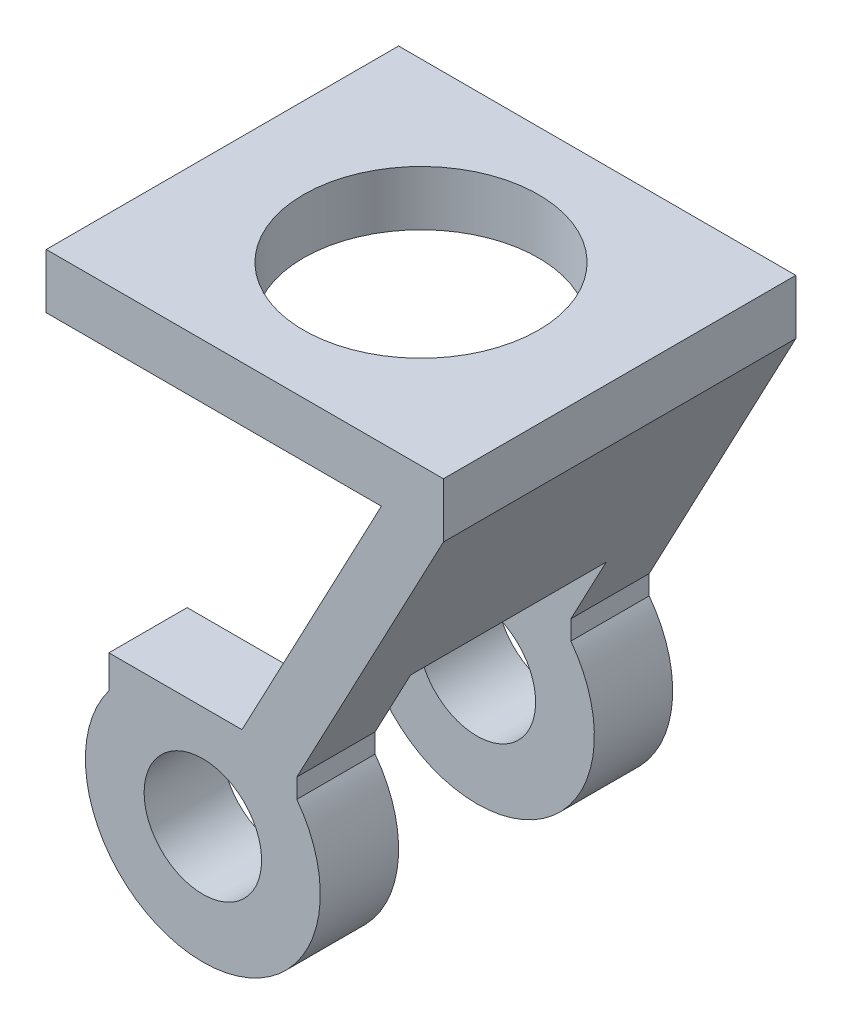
ISO-10303-21;
HEADER;
FILE_DESCRIPTION(('STEP AP214'),'2;1');
FILE_NAME('part.step','',(''),(''),'','','');
FILE_SCHEMA(('AUTOMOTIVE_DESIGN { 1 0 10303 214 1 1 1 1 }'));
ENDSEC;
DATA;
#1=APPLICATION_CONTEXT('core data for automotive mechanical design processes');
#2=APPLICATION_PROTOCOL_DEFINITION('international standard','automotive_design',2000,#1);
#3=PRODUCT_CONTEXT('',#1,'mechanical');
#4=PRODUCT('Part','Part','',(#3));
#5=PRODUCT_RELATED_PRODUCT_CATEGORY('part','',(#4));
#6=PRODUCT_DEFINITION_FORMATION('','',#4);
#7=PRODUCT_DEFINITION_CONTEXT('part definition',#1,'design');
#8=PRODUCT_DEFINITION('design','',#6,#7);
#9=PRODUCT_DEFINITION_SHAPE('','',#8);
#10=(LENGTH_UNIT() NAMED_UNIT(*) SI_UNIT(.MILLI.,.METRE.));
#11=(NAMED_UNIT(*) PLANE_ANGLE_UNIT() SI_UNIT($,.RADIAN.));
#12=(NAMED_UNIT(*) SI_UNIT($,.STERADIAN.) SOLID_ANGLE_UNIT());
#13=UNCERTAINTY_MEASURE_WITH_UNIT(LENGTH_MEASURE(1.E-05),#10,'distance_accuracy_value','');
#14=(GEOMETRIC_REPRESENTATION_CONTEXT(3) GLOBAL_UNCERTAINTY_ASSIGNED_CONTEXT((#13)) GLOBAL_UNIT_ASSIGNED_CONTEXT((#10,
#11,#12)) REPRESENTATION_CONTEXT('',''));
#15=CARTESIAN_POINT('',(0.,0.,0.));
#16=DIRECTION('',(0.,0.,1.));
#17=DIRECTION('',(1.,0.,0.));
#18=AXIS2_PLACEMENT_3D('',#15,#16,#17);
#19=CARTESIAN_POINT('',(5.,13.2086241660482,45.));
#20=DIRECTION('',(0.,-1.,0.));
#21=DIRECTION('',(1.,0.,0.));
#22=AXIS2_PLACEMENT_3D('',#19,#20,#21);
#23=PLANE('',#22);
#24=DIRECTION('',(0.,0.,-1.));
#25=VECTOR('',#24,1.);
#26=CARTESIAN_POINT('',(5.,13.2086241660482,45.));
#27=LINE('',#26,#25);
#28=CARTESIAN_POINT('',(5.,13.2086241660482,45.));
#29=VERTEX_POINT('',#28);
#30=CARTESIAN_POINT('',(5.,13.2086241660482,35.));
#31=VERTEX_POINT('',#30);
#32=EDGE_CURVE('E213',#29,#31,#27,.T.);
#33=ORIENTED_EDGE('',*,*,#32,.T.);
#34=DIRECTION('',(-1.,0.,0.));
#35=VECTOR('',#34,1.);
#36=CARTESIAN_POINT('',(5.,13.2086241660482,35.));
#37=LINE('',#36,#35);
#38=CARTESIAN_POINT('',(-12.,13.2086241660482,35.));
#39=VERTEX_POINT('',#38);
#40=EDGE_CURVE('E250',#31,#39,#37,.T.);
#41=ORIENTED_EDGE('',*,*,#40,.T.);
#42=DIRECTION('',(0.,0.,-1.));
#43=VECTOR('',#42,1.);
#44=CARTESIAN_POINT('',(-12.,13.2086241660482,45.));
#45=LINE('',#44,#43);
#46=CARTESIAN_POINT('',(-12.,13.2086241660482,45.));
#47=VERTEX_POINT('',#46);
#48=EDGE_CURVE('E209',#47,#39,#45,.T.);
#49=ORIENTED_EDGE('',*,*,#48,.F.);
#50=DIRECTION('',(-1.,0.,0.));
#51=VECTOR('',#50,1.);
#52=CARTESIAN_POINT('',(5.,13.2086241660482,45.));
#53=LINE('',#52,#51);
#54=EDGE_CURVE('E265',#29,#47,#53,.T.);
#55=ORIENTED_EDGE('',*,*,#54,.F.);
#56=EDGE_LOOP('',(#33,#41,#49,#55));
#57=FACE_BOUND('',#56,.T.);
#58=ADVANCED_FACE('F45',(#57),#23,.F.);
#59=CARTESIAN_POINT('',(-12.,13.2086241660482,45.));
#60=DIRECTION('',(1.,0.,0.));
#61=DIRECTION('',(0.,0.,-1.));
#62=AXIS2_PLACEMENT_3D('',#59,#60,#61);
#63=PLANE('',#62);
#64=ORIENTED_EDGE('',*,*,#48,.T.);
#65=DIRECTION('',(0.,-1.,0.));
#66=VECTOR('',#65,1.);
#67=CARTESIAN_POINT('',(-12.,13.2086241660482,35.));
#68=LINE('',#67,#66);
#69=CARTESIAN_POINT('',(-12.,9.,35.));
#70=VERTEX_POINT('',#69);
#71=EDGE_CURVE('E247',#39,#70,#68,.T.);
#72=ORIENTED_EDGE('',*,*,#71,.T.);
#73=DIRECTION('',(0.,0.,-1.));
#74=VECTOR('',#73,1.);
#75=CARTESIAN_POINT('',(-12.,9.,45.));
#76=LINE('',#75,#74);
#77=CARTESIAN_POINT('',(-12.,9.,45.));
#78=VERTEX_POINT('',#77);
#79=EDGE_CURVE('E205',#78,#70,#76,.T.);
#80=ORIENTED_EDGE('',*,*,#79,.F.);
#81=DIRECTION('',(0.,-1.,0.));
#82=VECTOR('',#81,1.);
#83=CARTESIAN_POINT('',(-12.,13.2086241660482,45.));
#84=LINE('',#83,#82);
#85=EDGE_CURVE('E267',#47,#78,#84,.T.);
#86=ORIENTED_EDGE('',*,*,#85,.F.);
#87=EDGE_LOOP('',(#64,#72,#80,#86));
#88=FACE_BOUND('',#87,.T.);
#89=ADVANCED_FACE('F302',(#88),#63,.F.);
#90=CARTESIAN_POINT('',(0.,0.,45.));
#91=DIRECTION('',(0.,0.,-1.));
#92=DIRECTION('',(-1.,0.,0.));
#93=AXIS2_PLACEMENT_3D('',#90,#91,#92);
#94=CYLINDRICAL_SURFACE('',#93,15.);
#95=CARTESIAN_POINT('',(0.,0.,35.));
#96=DIRECTION('',(0.,0.,1.));
#97=DIRECTION('',(0.,-1.,0.));
#98=AXIS2_PLACEMENT_3D('',#95,#96,#97);
#99=CIRCLE('',#98,15.);
#100=CARTESIAN_POINT('',(12.,9.,35.));
#101=VERTEX_POINT('',#100);
#102=EDGE_CURVE('E244',#70,#101,#99,.T.);
#103=ORIENTED_EDGE('',*,*,#102,.T.);
#104=DIRECTION('',(0.,0.,-1.));
#105=VECTOR('',#104,1.);
#106=CARTESIAN_POINT('',(12.,9.,45.));
#107=LINE('',#106,#105);
#108=CARTESIAN_POINT('',(12.,9.,45.));
#109=VERTEX_POINT('',#108);
#110=EDGE_CURVE('E201',#109,#101,#107,.T.);
#111=ORIENTED_EDGE('',*,*,#110,.F.);
#112=CARTESIAN_POINT('',(0.,0.,45.));
#113=DIRECTION('',(0.,0.,1.));
#114=DIRECTION('',(1.,0.,0.));
#115=AXIS2_PLACEMENT_3D('',#112,#113,#114);
#116=CIRCLE('',#115,15.);
#117=EDGE_CURVE('E269',#78,#109,#116,.T.);
#118=ORIENTED_EDGE('',*,*,#117,.F.);
#119=ORIENTED_EDGE('',*,*,#79,.T.);
#120=EDGE_LOOP('',(#103,#111,#118,#119));
#121=FACE_BOUND('',#120,.T.);
#122=ADVANCED_FACE('F306',(#121),#94,.T.);
#123=CARTESIAN_POINT('',(12.,9.,45.));
#124=DIRECTION('',(-1.,0.,0.));
#125=DIRECTION('',(0.,0.,1.));
#126=AXIS2_PLACEMENT_3D('',#123,#124,#125);
#127=PLANE('',#126);
#128=ORIENTED_EDGE('',*,*,#110,.T.);
#129=DIRECTION('',(0.,1.,0.));
#130=VECTOR('',#129,1.);
#131=CARTESIAN_POINT('',(12.,9.,35.));
#132=LINE('',#131,#130);
#133=CARTESIAN_POINT('',(12.,11.4693839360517,35.));
#134=VERTEX_POINT('',#133);
#135=EDGE_CURVE('E228',#101,#134,#132,.T.);
#136=ORIENTED_EDGE('',*,*,#135,.T.);
#137=DIRECTION('',(0.,0.,-1.));
#138=VECTOR('',#137,1.);
#139=CARTESIAN_POINT('',(12.,11.4693839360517,45.));
#140=LINE('',#139,#138);
#141=CARTESIAN_POINT('',(12.,11.4693839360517,45.));
#142=VERTEX_POINT('',#141);
#143=EDGE_CURVE('E197',#142,#134,#140,.T.);
#144=ORIENTED_EDGE('',*,*,#143,.F.);
#145=DIRECTION('',(0.,1.,0.));
#146=VECTOR('',#145,1.);
#147=CARTESIAN_POINT('',(12.,9.,45.));
#148=LINE('',#147,#146);
#149=EDGE_CURVE('E271',#109,#142,#148,.T.);
#150=ORIENTED_EDGE('',*,*,#149,.F.);
#151=EDGE_LOOP('',(#128,#136,#144,#150));
#152=FACE_BOUND('',#151,.T.);
#153=ADVANCED_FACE('F277',(#152),#127,.F.);
#154=CARTESIAN_POINT('',(0.,0.,45.));
#155=DIRECTION('',(0.,0.,-1.));
#156=DIRECTION('',(-1.,0.,0.));
#157=AXIS2_PLACEMENT_3D('',#154,#155,#156);
#158=CYLINDRICAL_SURFACE('',#157,7.5);
#159=CARTESIAN_POINT('',(0.,0.,35.));
#160=DIRECTION('',(0.,0.,1.));
#161=DIRECTION('',(0.,-1.,0.));
#162=AXIS2_PLACEMENT_3D('',#159,#160,#161);
#163=CIRCLE('',#162,7.5);
#164=CARTESIAN_POINT('',(-7.5,0.,35.));
#165=VERTEX_POINT('',#164);
#166=EDGE_CURVE('E221',#165,#165,#163,.T.);
#167=CARTESIAN_POINT('',(0.,0.,45.));
#168=DIRECTION('',(0.,0.,1.));
#169=DIRECTION('',(1.,0.,0.));
#170=AXIS2_PLACEMENT_3D('',#167,#168,#169);
#171=CIRCLE('',#170,7.5);
#172=CARTESIAN_POINT('',(-7.5,0.,45.));
#173=VERTEX_POINT('',#172);
#174=EDGE_CURVE('E171',#173,#173,#171,.T.);
#175=CARTESIAN_POINT('',(-7.5,0.,35.));
#176=CARTESIAN_POINT('',(-7.5,0.,35.1041666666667));
#177=CARTESIAN_POINT('',(-7.5,0.,35.2083333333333));
#178=CARTESIAN_POINT('',(-7.5,0.,35.4166666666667));
#179=CARTESIAN_POINT('',(-7.5,0.,35.5208333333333));
#180=CARTESIAN_POINT('',(-7.5,0.,35.7291666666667));
#181=CARTESIAN_POINT('',(-7.5,0.,35.8333333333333));
#182=CARTESIAN_POINT('',(-7.5,0.,36.0416666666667));
#183=CARTESIAN_POINT('',(-7.5,0.,36.1458333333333));
#184=CARTESIAN_POINT('',(-7.5,0.,36.3541666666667));
#185=CARTESIAN_POINT('',(-7.5,0.,36.4583333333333));
#186=CARTESIAN_POINT('',(-7.5,0.,36.6666666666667));
#187=CARTESIAN_POINT('',(-7.5,0.,36.7708333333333));
#188=CARTESIAN_POINT('',(-7.5,0.,36.9791666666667));
#189=CARTESIAN_POINT('',(-7.5,0.,37.0833333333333));
#190=CARTESIAN_POINT('',(-7.5,0.,37.2916666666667));
#191=CARTESIAN_POINT('',(-7.5,0.,37.3958333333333));
#192=CARTESIAN_POINT('',(-7.5,0.,37.6041666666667));
#193=CARTESIAN_POINT('',(-7.5,0.,37.7083333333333));
#194=CARTESIAN_POINT('',(-7.5,0.,37.9166666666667));
#195=CARTESIAN_POINT('',(-7.5,0.,38.0208333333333));
#196=CARTESIAN_POINT('',(-7.5,0.,38.2291666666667));
#197=CARTESIAN_POINT('',(-7.5,0.,38.3333333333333));
#198=CARTESIAN_POINT('',(-7.5,0.,38.5416666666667));
#199=CARTESIAN_POINT('',(-7.5,0.,38.6458333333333));
#200=CARTESIAN_POINT('',(-7.5,0.,38.8541666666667));
#201=CARTESIAN_POINT('',(-7.5,0.,38.9583333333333));
#202=CARTESIAN_POINT('',(-7.5,0.,39.1666666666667));
#203=CARTESIAN_POINT('',(-7.5,0.,39.2708333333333));
#204=CARTESIAN_POINT('',(-7.5,0.,39.4791666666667));
#205=CARTESIAN_POINT('',(-7.5,0.,39.5833333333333));
#206=CARTESIAN_POINT('',(-7.5,0.,39.7916666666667));
#207=CARTESIAN_POINT('',(-7.5,0.,39.8958333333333));
#208=CARTESIAN_POINT('',(-7.5,0.,40.1041666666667));
#209=CARTESIAN_POINT('',(-7.5,0.,40.2083333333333));
#210=CARTESIAN_POINT('',(-7.5,0.,40.4166666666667));
#211=CARTESIAN_POINT('',(-7.5,0.,40.5208333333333));
#212=CARTESIAN_POINT('',(-7.5,0.,40.7291666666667));
#213=CARTESIAN_POINT('',(-7.5,0.,40.8333333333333));
#214=CARTESIAN_POINT('',(-7.5,0.,41.0416666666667));
#215=CARTESIAN_POINT('',(-7.5,0.,41.1458333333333));
#216=CARTESIAN_POINT('',(-7.5,0.,41.3541666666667));
#217=CARTESIAN_POINT('',(-7.5,0.,41.4583333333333));
#218=CARTESIAN_POINT('',(-7.5,0.,41.6666666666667));
#219=CARTESIAN_POINT('',(-7.5,0.,41.7708333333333));
#220=CARTESIAN_POINT('',(-7.5,0.,41.9791666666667));
#221=CARTESIAN_POINT('',(-7.5,0.,42.0833333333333));
#222=CARTESIAN_POINT('',(-7.5,0.,42.2916666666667));
#223=CARTESIAN_POINT('',(-7.5,0.,42.3958333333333));
#224=CARTESIAN_POINT('',(-7.5,0.,42.6041666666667));
#225=CARTESIAN_POINT('',(-7.5,0.,42.7083333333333));
#226=CARTESIAN_POINT('',(-7.5,0.,42.9166666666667));
#227=CARTESIAN_POINT('',(-7.5,0.,43.0208333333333));
#228=CARTESIAN_POINT('',(-7.5,0.,43.2291666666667));
#229=CARTESIAN_POINT('',(-7.5,0.,43.3333333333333));
#230=CARTESIAN_POINT('',(-7.5,0.,43.5416666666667));
#231=CARTESIAN_POINT('',(-7.5,0.,43.6458333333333));
#232=CARTESIAN_POINT('',(-7.5,0.,43.8541666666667));
#233=CARTESIAN_POINT('',(-7.5,0.,43.9583333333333));
#234=CARTESIAN_POINT('',(-7.5,0.,44.1666666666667));
#235=CARTESIAN_POINT('',(-7.5,0.,44.2708333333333));
#236=CARTESIAN_POINT('',(-7.5,0.,44.4791666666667));
#237=CARTESIAN_POINT('',(-7.5,0.,44.5833333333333));
#238=CARTESIAN_POINT('',(-7.5,0.,44.7916666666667));
#239=CARTESIAN_POINT('',(-7.5,0.,44.8958333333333));
#240=CARTESIAN_POINT('',(-7.5,0.,45.));
#241=B_SPLINE_CURVE_WITH_KNOTS('',3,(#175,#176,#177,#178,#179,#180,#181,#182,#183,#184,#185,
#186,#187,#188,#189,#190,#191,#192,#193,#194,#195,#196,#197,#198,#199,#200,#201,#202,#203,#204,
#205,#206,#207,#208,#209,#210,#211,#212,#213,#214,#215,#216,#217,#218,#219,#220,#221,#222,#223,
#224,#225,#226,#227,#228,#229,#230,#231,#232,#233,#234,#235,#236,#237,#238,#239,#240),
.UNSPECIFIED.,.F.,.F.,(4,2,2,2,2,2,2,2,2,2,2,2,2,2,2,2,2,2,2,2,2,2,2,2,2,2,2,2,2,2,2,2,4),(0.,
0.3125,0.625000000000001,0.937500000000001,1.25,1.5625,1.875,2.1875,2.5,2.8125,3.125,3.4375,
3.75,4.0625,4.375,4.6875,5.,5.3125,5.62500000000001,5.93750000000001,6.25000000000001,
6.56250000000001,6.87500000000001,7.18750000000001,7.50000000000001,7.81250000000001,
8.12500000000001,8.43750000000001,8.75000000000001,9.06250000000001,9.37500000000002,
9.68750000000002,10.),.UNSPECIFIED.);
#242=EDGE_CURVE('BSEAM377',#165,#173,#241,.T.);
#243=ORIENTED_EDGE('',*,*,#166,.F.);
#244=ORIENTED_EDGE('',*,*,#174,.T.);
#245=ORIENTED_EDGE('',*,*,#242,.T.);
#246=ORIENTED_EDGE('',*,*,#242,.F.);
#247=EDGE_LOOP('',(#243,#245,#244,#246));
#248=FACE_BOUND('',#247,.T.);
#249=ADVANCED_FACE('F377',(#248),#158,.F.);
#250=CARTESIAN_POINT('',(0.,0.,45.));
#251=DIRECTION('',(0.,0.,1.));
#252=DIRECTION('',(1.,0.,0.));
#253=AXIS2_PLACEMENT_3D('',#250,#251,#252);
#254=PLANE('',#253);
#255=DIRECTION('',(1.,0.,0.));
#256=VECTOR('',#255,1.);
#257=CARTESIAN_POINT('',(-20.,46.8178370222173,45.));
#258=LINE('',#257,#256);
#259=CARTESIAN_POINT('',(-20.,46.8178370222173,45.));
#260=VERTEX_POINT('',#259);
#261=CARTESIAN_POINT('',(22.8001557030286,46.8178370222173,45.));
#262=VERTEX_POINT('',#261);
#263=EDGE_CURVE('E192',#260,#262,#258,.T.);
#264=ORIENTED_EDGE('',*,*,#263,.T.);
#265=DIRECTION('',(-0.468032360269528,-0.883711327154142,0.));
#266=VECTOR('',#265,1.);
#267=CARTESIAN_POINT('',(5.,13.2086241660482,45.));
#268=LINE('',#267,#266);
#269=EDGE_CURVE('E117',#262,#29,#268,.T.);
#270=ORIENTED_EDGE('',*,*,#269,.T.);
#271=ORIENTED_EDGE('',*,*,#54,.T.);
#272=ORIENTED_EDGE('',*,*,#85,.T.);
#273=ORIENTED_EDGE('',*,*,#117,.T.);
#274=ORIENTED_EDGE('',*,*,#149,.T.);
#275=DIRECTION('',(0.468032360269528,0.883711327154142,0.));
#276=VECTOR('',#275,1.);
#277=CARTESIAN_POINT('',(12.,11.4693839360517,45.));
#278=LINE('',#277,#276);
#279=CARTESIAN_POINT('',(30.7212944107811,46.8178370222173,45.));
#280=VERTEX_POINT('',#279);
#281=EDGE_CURVE('E146',#142,#280,#278,.T.);
#282=ORIENTED_EDGE('',*,*,#281,.T.);
#283=DIRECTION('',(0.,1.,0.));
#284=VECTOR('',#283,1.);
#285=CARTESIAN_POINT('',(30.7212944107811,46.8178370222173,45.));
#286=LINE('',#285,#284);
#287=CARTESIAN_POINT('',(30.7212944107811,53.8178370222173,45.));
#288=VERTEX_POINT('',#287);
#289=EDGE_CURVE('E138',#280,#288,#286,.T.);
#290=ORIENTED_EDGE('',*,*,#289,.T.);
#291=DIRECTION('',(-1.,0.,0.));
#292=VECTOR('',#291,1.);
#293=CARTESIAN_POINT('',(30.7212944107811,53.8178370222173,45.));
#294=LINE('',#293,#292);
#295=CARTESIAN_POINT('',(-20.,53.8178370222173,45.));
#296=VERTEX_POINT('',#295);
#297=EDGE_CURVE('E143',#288,#296,#294,.T.);
#298=ORIENTED_EDGE('',*,*,#297,.T.);
#299=DIRECTION('',(0.,-1.,0.));
#300=VECTOR('',#299,1.);
#301=CARTESIAN_POINT('',(-20.,53.8178370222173,45.));
#302=LINE('',#301,#300);
#303=EDGE_CURVE('E69',#296,#260,#302,.T.);
#304=ORIENTED_EDGE('',*,*,#303,.T.);
#305=EDGE_LOOP('',(#264,#270,#271,#272,#273,#274,#282,#290,#298,#304));
#306=FACE_BOUND('',#305,.T.);
#307=ORIENTED_EDGE('',*,*,#174,.F.);
#308=EDGE_LOOP('',(#307));
#309=FACE_BOUND('',#308,.T.);
#310=ADVANCED_FACE('F140',(#306,#309),#254,.T.);
#311=CARTESIAN_POINT('',(0.,0.,0.));
#312=DIRECTION('',(0.,0.,1.));
#313=DIRECTION('',(1.,0.,0.));
#314=AXIS2_PLACEMENT_3D('',#311,#312,#313);
#315=PLANE('',#314);
#316=DIRECTION('',(1.,0.,0.));
#317=VECTOR('',#316,1.);
#318=CARTESIAN_POINT('',(-20.,46.8178370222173,0.));
#319=LINE('',#318,#317);
#320=CARTESIAN_POINT('',(-20.,46.8178370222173,0.));
#321=VERTEX_POINT('',#320);
#322=CARTESIAN_POINT('',(22.8001557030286,46.8178370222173,0.));
#323=VERTEX_POINT('',#322);
#324=EDGE_CURVE('E167',#321,#323,#319,.T.);
#325=ORIENTED_EDGE('',*,*,#324,.F.);
#326=DIRECTION('',(0.,-1.,0.));
#327=VECTOR('',#326,1.);
#328=CARTESIAN_POINT('',(-20.,53.8178370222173,0.));
#329=LINE('',#328,#327);
#330=CARTESIAN_POINT('',(-20.,53.8178370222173,0.));
#331=VERTEX_POINT('',#330);
#332=EDGE_CURVE('E108',#331,#321,#329,.T.);
#333=ORIENTED_EDGE('',*,*,#332,.F.);
#334=DIRECTION('',(-1.,0.,0.));
#335=VECTOR('',#334,1.);
#336=CARTESIAN_POINT('',(30.7212944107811,53.8178370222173,0.));
#337=LINE('',#336,#335);
#338=CARTESIAN_POINT('',(30.7212944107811,53.8178370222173,0.));
#339=VERTEX_POINT('',#338);
#340=EDGE_CURVE('E189',#339,#331,#337,.T.);
#341=ORIENTED_EDGE('',*,*,#340,.F.);
#342=DIRECTION('',(0.,1.,0.));
#343=VECTOR('',#342,1.);
#344=CARTESIAN_POINT('',(30.7212944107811,46.8178370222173,0.));
#345=LINE('',#344,#343);
#346=CARTESIAN_POINT('',(30.7212944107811,46.8178370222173,0.));
#347=VERTEX_POINT('',#346);
#348=EDGE_CURVE('E155',#347,#339,#345,.T.);
#349=ORIENTED_EDGE('',*,*,#348,.F.);
#350=DIRECTION('',(0.468032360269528,0.883711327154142,0.));
#351=VECTOR('',#350,1.);
#352=CARTESIAN_POINT('',(12.,11.4693839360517,0.));
#353=LINE('',#352,#351);
#354=CARTESIAN_POINT('',(12.,11.4693839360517,0.));
#355=VERTEX_POINT('',#354);
#356=EDGE_CURVE('E186',#355,#347,#353,.T.);
#357=ORIENTED_EDGE('',*,*,#356,.F.);
#358=DIRECTION('',(0.,1.,0.));
#359=VECTOR('',#358,1.);
#360=CARTESIAN_POINT('',(12.,9.,0.));
#361=LINE('',#360,#359);
#362=CARTESIAN_POINT('',(12.,9.,0.));
#363=VERTEX_POINT('',#362);
#364=EDGE_CURVE('E183',#363,#355,#361,.T.);
#365=ORIENTED_EDGE('',*,*,#364,.F.);
#366=CARTESIAN_POINT('',(0.,0.,0.));
#367=DIRECTION('',(0.,0.,1.));
#368=DIRECTION('',(1.,0.,0.));
#369=AXIS2_PLACEMENT_3D('',#366,#367,#368);
#370=CIRCLE('',#369,15.);
#371=CARTESIAN_POINT('',(-12.,9.,0.));
#372=VERTEX_POINT('',#371);
#373=EDGE_CURVE('E180',#372,#363,#370,.T.);
#374=ORIENTED_EDGE('',*,*,#373,.F.);
#375=DIRECTION('',(0.,-1.,0.));
#376=VECTOR('',#375,1.);
#377=CARTESIAN_POINT('',(-12.,13.2086241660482,0.));
#378=LINE('',#377,#376);
#379=CARTESIAN_POINT('',(-12.,13.2086241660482,0.));
#380=VERTEX_POINT('',#379);
#381=EDGE_CURVE('E177',#380,#372,#378,.T.);
#382=ORIENTED_EDGE('',*,*,#381,.F.);
#383=DIRECTION('',(-1.,0.,0.));
#384=VECTOR('',#383,1.);
#385=CARTESIAN_POINT('',(5.,13.2086241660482,0.));
#386=LINE('',#385,#384);
#387=CARTESIAN_POINT('',(5.,13.2086241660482,0.));
#388=VERTEX_POINT('',#387);
#389=EDGE_CURVE('E174',#388,#380,#386,.T.);
#390=ORIENTED_EDGE('',*,*,#389,.F.);
#391=DIRECTION('',(-0.468032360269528,-0.883711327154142,0.));
#392=VECTOR('',#391,1.);
#393=CARTESIAN_POINT('',(5.,13.2086241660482,0.));
#394=LINE('',#393,#392);
#395=EDGE_CURVE('E170',#323,#388,#394,.T.);
#396=ORIENTED_EDGE('',*,*,#395,.F.);
#397=EDGE_LOOP('',(#325,#333,#341,#349,#357,#365,#374,#382,#390,#396));
#398=FACE_BOUND('',#397,.T.);
#399=CARTESIAN_POINT('',(0.,0.,0.));
#400=DIRECTION('',(0.,0.,1.));
#401=DIRECTION('',(1.,0.,0.));
#402=AXIS2_PLACEMENT_3D('',#399,#400,#401);
#403=CIRCLE('',#402,7.5);
#404=CARTESIAN_POINT('',(-7.5,0.,0.));
#405=VERTEX_POINT('',#404);
#406=EDGE_CURVE('E258',#405,#405,#403,.T.);
#407=ORIENTED_EDGE('',*,*,#406,.T.);
#408=EDGE_LOOP('',(#407));
#409=FACE_BOUND('',#408,.T.);
#410=ADVANCED_FACE('F285',(#398,#409),#315,.F.);
#411=CARTESIAN_POINT('',(-20.,46.8178370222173,45.));
#412=DIRECTION('',(0.,1.,0.));
#413=DIRECTION('',(0.,0.,1.));
#414=AXIS2_PLACEMENT_3D('',#411,#412,#413);
#415=PLANE('',#414);
#416=CARTESIAN_POINT('',(5.36064720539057,46.8178370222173,22.5));
#417=DIRECTION('',(0.,1.,0.));
#418=DIRECTION('',(0.,0.,1.));
#419=AXIS2_PLACEMENT_3D('',#416,#417,#418);
#420=CIRCLE('',#419,15.);
#421=CARTESIAN_POINT('',(5.36064720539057,46.8178370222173,37.5));
#422=VERTEX_POINT('',#421);
#423=EDGE_CURVE('E330',#422,#422,#420,.F.);
#424=ORIENTED_EDGE('',*,*,#423,.F.);
#425=EDGE_LOOP('',(#424));
#426=FACE_BOUND('',#425,.T.);
#427=ORIENTED_EDGE('',*,*,#324,.T.);
#428=DIRECTION('',(0.,0.,-1.));
#429=VECTOR('',#428,1.);
#430=CARTESIAN_POINT('',(22.8001557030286,46.8178370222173,45.));
#431=LINE('',#430,#429);
#432=EDGE_CURVE('E53',#262,#323,#431,.T.);
#433=ORIENTED_EDGE('',*,*,#432,.F.);
#434=ORIENTED_EDGE('',*,*,#263,.F.);
#435=DIRECTION('',(0.,0.,-1.));
#436=VECTOR('',#435,1.);
#437=CARTESIAN_POINT('',(-20.,46.8178370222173,45.));
#438=LINE('',#437,#436);
#439=EDGE_CURVE('E163',#260,#321,#438,.T.);
#440=ORIENTED_EDGE('',*,*,#439,.T.);
#441=EDGE_LOOP('',(#427,#433,#434,#440));
#442=FACE_BOUND('',#441,.T.);
#443=ADVANCED_FACE('F47',(#426,#442),#415,.F.);
#444=CARTESIAN_POINT('',(5.,13.2086241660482,45.));
#445=DIRECTION('',(0.883711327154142,-0.468032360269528,0.));
#446=DIRECTION('',(0.468032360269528,0.883711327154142,0.));
#447=AXIS2_PLACEMENT_3D('',#444,#445,#446);
#448=PLANE('',#447);
#449=DIRECTION('',(0.,0.,1.));
#450=VECTOR('',#449,1.);
#451=CARTESIAN_POINT('',(8.60272378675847,20.011076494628,45.));
#452=LINE('',#451,#450);
#453=CARTESIAN_POINT('',(8.60272378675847,20.011076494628,10.));
#454=VERTEX_POINT('',#453);
#455=CARTESIAN_POINT('',(8.60272378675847,20.011076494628,35.));
#456=VERTEX_POINT('',#455);
#457=EDGE_CURVE('E256',#454,#456,#452,.T.);
#458=ORIENTED_EDGE('',*,*,#457,.T.);
#459=DIRECTION('',(-0.468032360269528,-0.883711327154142,0.));
#460=VECTOR('',#459,1.);
#461=CARTESIAN_POINT('',(5.,13.2086241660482,35.));
#462=LINE('',#461,#460);
#463=EDGE_CURVE('E253',#456,#31,#462,.T.);
#464=ORIENTED_EDGE('',*,*,#463,.T.);
#465=ORIENTED_EDGE('',*,*,#32,.F.);
#466=ORIENTED_EDGE('',*,*,#269,.F.);
#467=ORIENTED_EDGE('',*,*,#432,.T.);
#468=ORIENTED_EDGE('',*,*,#395,.T.);
#469=CARTESIAN_POINT('',(5.,13.2086241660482,10.));
#470=VERTEX_POINT('',#469);
#471=EDGE_CURVE('E212',#470,#388,#27,.T.);
#472=ORIENTED_EDGE('',*,*,#471,.F.);
#473=DIRECTION('',(0.468032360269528,0.883711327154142,0.));
#474=VECTOR('',#473,1.);
#475=CARTESIAN_POINT('',(5.,13.2086241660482,10.));
#476=LINE('',#475,#474);
#477=EDGE_CURVE('E224',#470,#454,#476,.T.);
#478=ORIENTED_EDGE('',*,*,#477,.T.);
#479=EDGE_LOOP('',(#458,#464,#465,#466,#467,#468,#472,#478));
#480=FACE_BOUND('',#479,.T.);
#481=ADVANCED_FACE('F294',(#480),#448,.F.);
#482=CARTESIAN_POINT('',(-12.,13.2086241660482,10.));
#483=VERTEX_POINT('',#482);
#484=EDGE_CURVE('E208',#483,#380,#45,.T.);
#485=ORIENTED_EDGE('',*,*,#484,.F.);
#486=DIRECTION('',(1.,0.,0.));
#487=VECTOR('',#486,1.);
#488=CARTESIAN_POINT('',(5.,13.2086241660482,10.));
#489=LINE('',#488,#487);
#490=EDGE_CURVE('E231',#483,#470,#489,.T.);
#491=ORIENTED_EDGE('',*,*,#490,.T.);
#492=ORIENTED_EDGE('',*,*,#471,.T.);
#493=ORIENTED_EDGE('',*,*,#389,.T.);
#494=EDGE_LOOP('',(#485,#491,#492,#493));
#495=FACE_BOUND('',#494,.T.);
#496=ADVANCED_FACE('F350',(#495),#23,.F.);
#497=CARTESIAN_POINT('',(-12.,9.,10.));
#498=VERTEX_POINT('',#497);
#499=EDGE_CURVE('E204',#498,#372,#76,.T.);
#500=ORIENTED_EDGE('',*,*,#499,.F.);
#501=DIRECTION('',(0.,1.,0.));
#502=VECTOR('',#501,1.);
#503=CARTESIAN_POINT('',(-12.,13.2086241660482,10.));
#504=LINE('',#503,#502);
#505=EDGE_CURVE('E238',#498,#483,#504,.T.);
#506=ORIENTED_EDGE('',*,*,#505,.T.);
#507=ORIENTED_EDGE('',*,*,#484,.T.);
#508=ORIENTED_EDGE('',*,*,#381,.T.);
#509=EDGE_LOOP('',(#500,#506,#507,#508));
#510=FACE_BOUND('',#509,.T.);
#511=ADVANCED_FACE('F345',(#510),#63,.F.);
#512=CARTESIAN_POINT('',(0.,0.,10.));
#513=DIRECTION('',(0.,0.,-1.));
#514=DIRECTION('',(0.,1.,0.));
#515=AXIS2_PLACEMENT_3D('',#512,#513,#514);
#516=CIRCLE('',#515,15.);
#517=CARTESIAN_POINT('',(12.,9.,10.));
#518=VERTEX_POINT('',#517);
#519=EDGE_CURVE('E337',#518,#498,#516,.T.);
#520=ORIENTED_EDGE('',*,*,#519,.T.);
#521=ORIENTED_EDGE('',*,*,#499,.T.);
#522=ORIENTED_EDGE('',*,*,#373,.T.);
#523=EDGE_CURVE('E200',#518,#363,#107,.T.);
#524=ORIENTED_EDGE('',*,*,#523,.F.);
#525=EDGE_LOOP('',(#520,#521,#522,#524));
#526=FACE_BOUND('',#525,.T.);
#527=ADVANCED_FACE('F356',(#526),#94,.T.);
#528=CARTESIAN_POINT('',(12.,11.4693839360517,10.));
#529=VERTEX_POINT('',#528);
#530=EDGE_CURVE('E196',#529,#355,#140,.T.);
#531=ORIENTED_EDGE('',*,*,#530,.F.);
#532=DIRECTION('',(0.,-1.,0.));
#533=VECTOR('',#532,1.);
#534=CARTESIAN_POINT('',(12.,9.00000000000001,10.));
#535=LINE('',#534,#533);
#536=EDGE_CURVE('E60',#529,#518,#535,.T.);
#537=ORIENTED_EDGE('',*,*,#536,.T.);
#538=ORIENTED_EDGE('',*,*,#523,.T.);
#539=ORIENTED_EDGE('',*,*,#364,.T.);
#540=EDGE_LOOP('',(#531,#537,#538,#539));
#541=FACE_BOUND('',#540,.T.);
#542=ADVANCED_FACE('F364',(#541),#127,.F.);
#543=CARTESIAN_POINT('',(12.,11.4693839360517,45.));
#544=DIRECTION('',(-0.883711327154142,0.468032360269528,0.));
#545=DIRECTION('',(-0.468032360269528,-0.883711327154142,0.));
#546=AXIS2_PLACEMENT_3D('',#543,#544,#545);
#547=PLANE('',#546);
#548=ORIENTED_EDGE('',*,*,#143,.T.);
#549=DIRECTION('',(0.468032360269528,0.883711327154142,0.));
#550=VECTOR('',#549,1.);
#551=CARTESIAN_POINT('',(12.,11.4693839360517,35.));
#552=LINE('',#551,#550);
#553=CARTESIAN_POINT('',(16.523862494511,20.011076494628,35.));
#554=VERTEX_POINT('',#553);
#555=EDGE_CURVE('E223',#134,#554,#552,.T.);
#556=ORIENTED_EDGE('',*,*,#555,.T.);
#557=DIRECTION('',(0.,0.,-1.));
#558=VECTOR('',#557,1.);
#559=CARTESIAN_POINT('',(16.523862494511,20.011076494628,45.));
#560=LINE('',#559,#558);
#561=CARTESIAN_POINT('',(16.523862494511,20.011076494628,10.));
#562=VERTEX_POINT('',#561);
#563=EDGE_CURVE('E11',#554,#562,#560,.T.);
#564=ORIENTED_EDGE('',*,*,#563,.T.);
#565=DIRECTION('',(-0.468032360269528,-0.883711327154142,0.));
#566=VECTOR('',#565,1.);
#567=CARTESIAN_POINT('',(12.,11.4693839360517,10.));
#568=LINE('',#567,#566);
#569=EDGE_CURVE('E219',#562,#529,#568,.T.);
#570=ORIENTED_EDGE('',*,*,#569,.T.);
#571=ORIENTED_EDGE('',*,*,#530,.T.);
#572=ORIENTED_EDGE('',*,*,#356,.T.);
#573=DIRECTION('',(0.,0.,-1.));
#574=VECTOR('',#573,1.);
#575=CARTESIAN_POINT('',(30.7212944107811,46.8178370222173,45.));
#576=LINE('',#575,#574);
#577=EDGE_CURVE('E158',#280,#347,#576,.T.);
#578=ORIENTED_EDGE('',*,*,#577,.F.);
#579=ORIENTED_EDGE('',*,*,#281,.F.);
#580=EDGE_LOOP('',(#548,#556,#564,#570,#571,#572,#578,#579));
#581=FACE_BOUND('',#580,.T.);
#582=ADVANCED_FACE('F281',(#581),#547,.F.);
#583=CARTESIAN_POINT('',(30.7212944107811,46.8178370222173,45.));
#584=DIRECTION('',(-1.,0.,0.));
#585=DIRECTION('',(0.,0.,1.));
#586=AXIS2_PLACEMENT_3D('',#583,#584,#585);
#587=PLANE('',#586);
#588=ORIENTED_EDGE('',*,*,#348,.T.);
#589=DIRECTION('',(0.,0.,-1.));
#590=VECTOR('',#589,1.);
#591=CARTESIAN_POINT('',(30.7212944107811,53.8178370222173,45.));
#592=LINE('',#591,#590);
#593=EDGE_CURVE('E152',#288,#339,#592,.T.);
#594=ORIENTED_EDGE('',*,*,#593,.F.);
#595=ORIENTED_EDGE('',*,*,#289,.F.);
#596=ORIENTED_EDGE('',*,*,#577,.T.);
#597=EDGE_LOOP('',(#588,#594,#595,#596));
#598=FACE_BOUND('',#597,.T.);
#599=ADVANCED_FACE('F153',(#598),#587,.F.);
#600=CARTESIAN_POINT('',(30.7212944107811,53.8178370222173,45.));
#601=DIRECTION('',(0.,-1.,0.));
#602=DIRECTION('',(1.,0.,0.));
#603=AXIS2_PLACEMENT_3D('',#600,#601,#602);
#604=PLANE('',#603);
#605=CARTESIAN_POINT('',(5.36064720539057,53.8178370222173,22.5));
#606=DIRECTION('',(0.,1.,0.));
#607=DIRECTION('',(-1.,0.,0.));
#608=AXIS2_PLACEMENT_3D('',#605,#606,#607);
#609=CIRCLE('',#608,15.);
#610=CARTESIAN_POINT('',(-9.63935279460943,53.8178370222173,22.5));
#611=VERTEX_POINT('',#610);
#612=EDGE_CURVE('E404',#611,#611,#609,.T.);
#613=ORIENTED_EDGE('',*,*,#612,.F.);
#614=EDGE_LOOP('',(#613));
#615=FACE_BOUND('',#614,.T.);
#616=ORIENTED_EDGE('',*,*,#340,.T.);
#617=DIRECTION('',(0.,0.,-1.));
#618=VECTOR('',#617,1.);
#619=CARTESIAN_POINT('',(-20.,53.8178370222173,45.));
#620=LINE('',#619,#618);
#621=EDGE_CURVE('E159',#296,#331,#620,.T.);
#622=ORIENTED_EDGE('',*,*,#621,.F.);
#623=ORIENTED_EDGE('',*,*,#297,.F.);
#624=ORIENTED_EDGE('',*,*,#593,.T.);
#625=EDGE_LOOP('',(#616,#622,#623,#624));
#626=FACE_BOUND('',#625,.T.);
#627=ADVANCED_FACE('F161',(#615,#626),#604,.F.);
#628=CARTESIAN_POINT('',(-20.,53.8178370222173,45.));
#629=DIRECTION('',(1.,0.,0.));
#630=DIRECTION('',(0.,1.,0.));
#631=AXIS2_PLACEMENT_3D('',#628,#629,#630);
#632=PLANE('',#631);
#633=ORIENTED_EDGE('',*,*,#332,.T.);
#634=ORIENTED_EDGE('',*,*,#439,.F.);
#635=ORIENTED_EDGE('',*,*,#303,.F.);
#636=ORIENTED_EDGE('',*,*,#621,.T.);
#637=EDGE_LOOP('',(#633,#634,#635,#636));
#638=FACE_BOUND('',#637,.T.);
#639=ADVANCED_FACE('F288',(#638),#632,.F.);
#640=CARTESIAN_POINT('',(0.,0.,10.));
#641=DIRECTION('',(0.,0.,-1.));
#642=DIRECTION('',(0.,1.,0.));
#643=AXIS2_PLACEMENT_3D('',#640,#641,#642);
#644=CIRCLE('',#643,7.5);
#645=CARTESIAN_POINT('',(-7.5,0.,10.));
#646=VERTEX_POINT('',#645);
#647=EDGE_CURVE('E217',#646,#646,#644,.T.);
#648=CARTESIAN_POINT('',(-7.5,0.,10.));
#649=CARTESIAN_POINT('',(-7.5,0.,9.89583333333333));
#650=CARTESIAN_POINT('',(-7.5,0.,9.79166666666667));
#651=CARTESIAN_POINT('',(-7.5,0.,9.58333333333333));
#652=CARTESIAN_POINT('',(-7.5,0.,9.47916666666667));
#653=CARTESIAN_POINT('',(-7.5,0.,9.27083333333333));
#654=CARTESIAN_POINT('',(-7.5,0.,9.16666666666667));
#655=CARTESIAN_POINT('',(-7.5,0.,8.95833333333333));
#656=CARTESIAN_POINT('',(-7.5,0.,8.85416666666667));
#657=CARTESIAN_POINT('',(-7.5,0.,8.64583333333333));
#658=CARTESIAN_POINT('',(-7.5,0.,8.54166666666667));
#659=CARTESIAN_POINT('',(-7.5,0.,8.33333333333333));
#660=CARTESIAN_POINT('',(-7.5,0.,8.22916666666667));
#661=CARTESIAN_POINT('',(-7.5,0.,8.02083333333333));
#662=CARTESIAN_POINT('',(-7.5,0.,7.91666666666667));
#663=CARTESIAN_POINT('',(-7.5,0.,7.70833333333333));
#664=CARTESIAN_POINT('',(-7.5,0.,7.60416666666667));
#665=CARTESIAN_POINT('',(-7.5,0.,7.39583333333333));
#666=CARTESIAN_POINT('',(-7.5,0.,7.29166666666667));
#667=CARTESIAN_POINT('',(-7.5,0.,7.08333333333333));
#668=CARTESIAN_POINT('',(-7.5,0.,6.97916666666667));
#669=CARTESIAN_POINT('',(-7.5,0.,6.77083333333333));
#670=CARTESIAN_POINT('',(-7.5,0.,6.66666666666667));
#671=CARTESIAN_POINT('',(-7.5,0.,6.45833333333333));
#672=CARTESIAN_POINT('',(-7.5,0.,6.35416666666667));
#673=CARTESIAN_POINT('',(-7.5,0.,6.14583333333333));
#674=CARTESIAN_POINT('',(-7.5,0.,6.04166666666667));
#675=CARTESIAN_POINT('',(-7.5,0.,5.83333333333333));
#676=CARTESIAN_POINT('',(-7.5,0.,5.72916666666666));
#677=CARTESIAN_POINT('',(-7.5,0.,5.52083333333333));
#678=CARTESIAN_POINT('',(-7.5,0.,5.41666666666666));
#679=CARTESIAN_POINT('',(-7.5,0.,5.20833333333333));
#680=CARTESIAN_POINT('',(-7.5,0.,5.10416666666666));
#681=CARTESIAN_POINT('',(-7.5,0.,4.89583333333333));
#682=CARTESIAN_POINT('',(-7.5,0.,4.79166666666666));
#683=CARTESIAN_POINT('',(-7.5,0.,4.58333333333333));
#684=CARTESIAN_POINT('',(-7.5,0.,4.47916666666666));
#685=CARTESIAN_POINT('',(-7.5,0.,4.27083333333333));
#686=CARTESIAN_POINT('',(-7.5,0.,4.16666666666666));
#687=CARTESIAN_POINT('',(-7.5,0.,3.95833333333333));
#688=CARTESIAN_POINT('',(-7.5,0.,3.85416666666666));
#689=CARTESIAN_POINT('',(-7.5,0.,3.64583333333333));
#690=CARTESIAN_POINT('',(-7.5,0.,3.54166666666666));
#691=CARTESIAN_POINT('',(-7.5,0.,3.33333333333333));
#692=CARTESIAN_POINT('',(-7.5,0.,3.22916666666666));
#693=CARTESIAN_POINT('',(-7.5,0.,3.02083333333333));
#694=CARTESIAN_POINT('',(-7.5,0.,2.91666666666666));
#695=CARTESIAN_POINT('',(-7.5,0.,2.70833333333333));
#696=CARTESIAN_POINT('',(-7.5,0.,2.60416666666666));
#697=CARTESIAN_POINT('',(-7.5,0.,2.39583333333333));
#698=CARTESIAN_POINT('',(-7.5,0.,2.29166666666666));
#699=CARTESIAN_POINT('',(-7.5,0.,2.08333333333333));
#700=CARTESIAN_POINT('',(-7.5,0.,1.97916666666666));
#701=CARTESIAN_POINT('',(-7.5,0.,1.77083333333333));
#702=CARTESIAN_POINT('',(-7.5,0.,1.66666666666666));
#703=CARTESIAN_POINT('',(-7.5,0.,1.45833333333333));
#704=CARTESIAN_POINT('',(-7.5,0.,1.35416666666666));
#705=CARTESIAN_POINT('',(-7.5,0.,1.14583333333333));
#706=CARTESIAN_POINT('',(-7.5,0.,1.04166666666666));
#707=CARTESIAN_POINT('',(-7.5,0.,0.833333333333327));
#708=CARTESIAN_POINT('',(-7.5,0.,0.72916666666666));
#709=CARTESIAN_POINT('',(-7.5,0.,0.520833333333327));
#710=CARTESIAN_POINT('',(-7.5,0.,0.41666666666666));
#711=CARTESIAN_POINT('',(-7.5,0.,0.208333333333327));
#712=CARTESIAN_POINT('',(-7.5,0.,0.10416666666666));
#713=CARTESIAN_POINT('',(-7.5,0.,0.));
#714=B_SPLINE_CURVE_WITH_KNOTS('',3,(#648,#649,#650,#651,#652,#653,#654,#655,#656,#657,#658,
#659,#660,#661,#662,#663,#664,#665,#666,#667,#668,#669,#670,#671,#672,#673,#674,#675,#676,#677,
#678,#679,#680,#681,#682,#683,#684,#685,#686,#687,#688,#689,#690,#691,#692,#693,#694,#695,#696,
#697,#698,#699,#700,#701,#702,#703,#704,#705,#706,#707,#708,#709,#710,#711,#712,#713),
.UNSPECIFIED.,.F.,.F.,(4,2,2,2,2,2,2,2,2,2,2,2,2,2,2,2,2,2,2,2,2,2,2,2,2,2,2,2,2,2,2,2,4),(0.,
0.3125,0.625000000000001,0.937500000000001,1.25,1.5625,1.875,2.1875,2.5,2.8125,3.125,3.4375,
3.75,4.0625,4.375,4.6875,5.,5.3125,5.62500000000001,5.93750000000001,6.25000000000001,
6.56250000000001,6.87500000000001,7.18750000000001,7.50000000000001,7.81250000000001,
8.12500000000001,8.43750000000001,8.75000000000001,9.06250000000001,9.37500000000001,
9.68750000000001,10.),.UNSPECIFIED.);
#715=EDGE_CURVE('BSEAM414',#646,#405,#714,.T.);
#716=ORIENTED_EDGE('',*,*,#647,.F.);
#717=ORIENTED_EDGE('',*,*,#406,.F.);
#718=ORIENTED_EDGE('',*,*,#715,.T.);
#719=ORIENTED_EDGE('',*,*,#715,.F.);
#720=EDGE_LOOP('',(#716,#718,#717,#719));
#721=FACE_BOUND('',#720,.T.);
#722=ADVANCED_FACE('F414',(#721),#158,.F.);
#723=CARTESIAN_POINT('',(-30.2787055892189,20.011076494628,10.));
#724=DIRECTION('',(0.,1.,0.));
#725=DIRECTION('',(0.,0.,1.));
#726=AXIS2_PLACEMENT_3D('',#723,#724,#725);
#727=PLANE('',#726);
#728=DIRECTION('',(1.,0.,0.));
#729=VECTOR('',#728,1.);
#730=CARTESIAN_POINT('',(-30.2787055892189,20.011076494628,10.));
#731=LINE('',#730,#729);
#732=EDGE_CURVE('E328',#454,#562,#731,.T.);
#733=ORIENTED_EDGE('',*,*,#732,.T.);
#734=ORIENTED_EDGE('',*,*,#563,.F.);
#735=DIRECTION('',(1.,0.,0.));
#736=VECTOR('',#735,1.);
#737=CARTESIAN_POINT('',(-30.2787055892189,20.011076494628,35.));
#738=LINE('',#737,#736);
#739=EDGE_CURVE('E220',#456,#554,#738,.T.);
#740=ORIENTED_EDGE('',*,*,#739,.F.);
#741=ORIENTED_EDGE('',*,*,#457,.F.);
#742=EDGE_LOOP('',(#733,#734,#740,#741));
#743=FACE_BOUND('',#742,.T.);
#744=ADVANCED_FACE('F326',(#743),#727,.F.);
#745=CARTESIAN_POINT('',(-30.2787055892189,20.011076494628,35.));
#746=DIRECTION('',(0.,0.,1.));
#747=DIRECTION('',(0.,-1.,0.));
#748=AXIS2_PLACEMENT_3D('',#745,#746,#747);
#749=PLANE('',#748);
#750=ORIENTED_EDGE('',*,*,#166,.T.);
#751=EDGE_LOOP('',(#750));
#752=FACE_BOUND('',#751,.T.);
#753=ORIENTED_EDGE('',*,*,#739,.T.);
#754=ORIENTED_EDGE('',*,*,#555,.F.);
#755=ORIENTED_EDGE('',*,*,#135,.F.);
#756=ORIENTED_EDGE('',*,*,#102,.F.);
#757=ORIENTED_EDGE('',*,*,#71,.F.);
#758=ORIENTED_EDGE('',*,*,#40,.F.);
#759=ORIENTED_EDGE('',*,*,#463,.F.);
#760=EDGE_LOOP('',(#753,#754,#755,#756,#757,#758,#759));
#761=FACE_BOUND('',#760,.T.);
#762=ADVANCED_FACE('F317',(#752,#761),#749,.F.);
#763=CARTESIAN_POINT('',(-30.2787055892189,-15.,10.));
#764=DIRECTION('',(0.,0.,-1.));
#765=DIRECTION('',(0.,1.,0.));
#766=AXIS2_PLACEMENT_3D('',#763,#764,#765);
#767=PLANE('',#766);
#768=ORIENTED_EDGE('',*,*,#647,.T.);
#769=EDGE_LOOP('',(#768));
#770=FACE_BOUND('',#769,.T.);
#771=ORIENTED_EDGE('',*,*,#490,.F.);
#772=ORIENTED_EDGE('',*,*,#505,.F.);
#773=ORIENTED_EDGE('',*,*,#519,.F.);
#774=ORIENTED_EDGE('',*,*,#536,.F.);
#775=ORIENTED_EDGE('',*,*,#569,.F.);
#776=ORIENTED_EDGE('',*,*,#732,.F.);
#777=ORIENTED_EDGE('',*,*,#477,.F.);
#778=EDGE_LOOP('',(#771,#772,#773,#774,#775,#776,#777));
#779=FACE_BOUND('',#778,.T.);
#780=ADVANCED_FACE('F359',(#770,#779),#767,.F.);
#781=CARTESIAN_POINT('',(5.36064720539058,4.39143015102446,22.5));
#782=DIRECTION('',(0.,1.,0.));
#783=DIRECTION('',(-1.,0.,0.));
#784=AXIS2_PLACEMENT_3D('',#781,#782,#783);
#785=CYLINDRICAL_SURFACE('',#784,15.);
#786=ORIENTED_EDGE('',*,*,#423,.T.);
#787=EDGE_LOOP('',(#786));
#788=FACE_BOUND('',#787,.T.);
#789=ORIENTED_EDGE('',*,*,#612,.T.);
#790=EDGE_LOOP('',(#789));
#791=FACE_BOUND('',#790,.T.);
#792=ADVANCED_FACE('F408',(#788,#791),#785,.F.);
#793=CLOSED_SHELL('',(#58,#89,#122,#153,#249,#310,#410,#443,#481,#496,#511,#527,#542,#582,#599,
#627,#639,#722,#744,#762,#780,#792));
#794=MANIFOLD_SOLID_BREP('B2',#793);
#795=ADVANCED_BREP_SHAPE_REPRESENTATION('',(#18,#794),#14);
#796=SHAPE_DEFINITION_REPRESENTATION(#9,#795);
ENDSEC;
END-ISO-10303-21;
